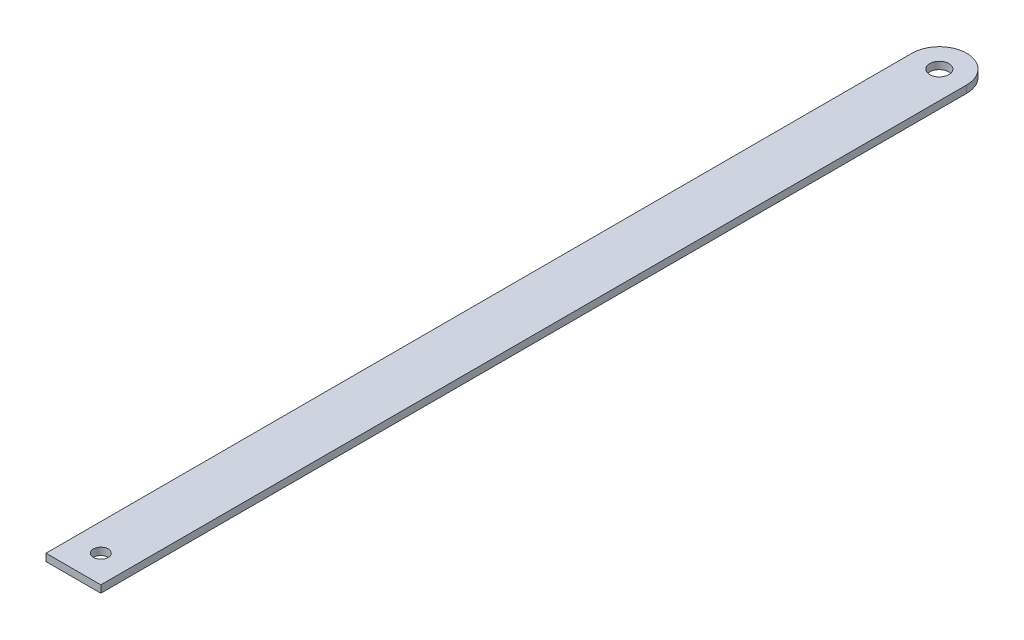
ISO-10303-21;
HEADER;
FILE_DESCRIPTION(('STEP AP214'),'2;1');
FILE_NAME('part.step','',(''),(''),'','','');
FILE_SCHEMA(('AUTOMOTIVE_DESIGN { 1 0 10303 214 1 1 1 1 }'));
ENDSEC;
DATA;
#1=APPLICATION_CONTEXT('core data for automotive mechanical design processes');
#2=APPLICATION_PROTOCOL_DEFINITION('international standard','automotive_design',2000,#1);
#3=PRODUCT_CONTEXT('',#1,'mechanical');
#4=PRODUCT('Part','Part','',(#3));
#5=PRODUCT_RELATED_PRODUCT_CATEGORY('part','',(#4));
#6=PRODUCT_DEFINITION_FORMATION('','',#4);
#7=PRODUCT_DEFINITION_CONTEXT('part definition',#1,'design');
#8=PRODUCT_DEFINITION('design','',#6,#7);
#9=PRODUCT_DEFINITION_SHAPE('','',#8);
#10=(LENGTH_UNIT() NAMED_UNIT(*) SI_UNIT(.MILLI.,.METRE.));
#11=(NAMED_UNIT(*) PLANE_ANGLE_UNIT() SI_UNIT($,.RADIAN.));
#12=(NAMED_UNIT(*) SI_UNIT($,.STERADIAN.) SOLID_ANGLE_UNIT());
#13=UNCERTAINTY_MEASURE_WITH_UNIT(LENGTH_MEASURE(1.E-05),#10,'distance_accuracy_value','');
#14=(GEOMETRIC_REPRESENTATION_CONTEXT(3) GLOBAL_UNCERTAINTY_ASSIGNED_CONTEXT((#13)) GLOBAL_UNIT_ASSIGNED_CONTEXT((#10,
#11,#12)) REPRESENTATION_CONTEXT('',''));
#15=CARTESIAN_POINT('',(0.,0.,0.));
#16=DIRECTION('',(0.,0.,1.));
#17=DIRECTION('',(1.,0.,0.));
#18=AXIS2_PLACEMENT_3D('',#15,#16,#17);
#19=CARTESIAN_POINT('',(1141.63509440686,4.,-1873.52597023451));
#20=DIRECTION('',(0.,1.,0.));
#21=DIRECTION('',(0.,0.,1.));
#22=AXIS2_PLACEMENT_3D('',#19,#20,#21);
#23=PLANE('',#22);
#24=CARTESIAN_POINT('',(1141.63509440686,4.,-1873.52597023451));
#25=DIRECTION('',(0.,1.,0.));
#26=DIRECTION('',(0.,0.,1.));
#27=AXIS2_PLACEMENT_3D('',#24,#25,#26);
#28=CIRCLE('',#27,5.25000000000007);
#29=CARTESIAN_POINT('',(1141.63509440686,4.,-1868.27597023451));
#30=VERTEX_POINT('',#29);
#31=EDGE_CURVE('E99',#30,#30,#28,.T.);
#32=ORIENTED_EDGE('',*,*,#31,.F.);
#33=EDGE_LOOP('',(#32));
#34=FACE_BOUND('',#33,.T.);
#35=CARTESIAN_POINT('',(1141.63509440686,4.,-1873.52597023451));
#36=DIRECTION('',(0.,1.,0.));
#37=DIRECTION('',(0.,0.,1.));
#38=AXIS2_PLACEMENT_3D('',#35,#36,#37);
#39=CIRCLE('',#38,15.);
#40=CARTESIAN_POINT('',(1156.63509440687,4.,-1873.52597023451));
#41=VERTEX_POINT('',#40);
#42=CARTESIAN_POINT('',(1126.63509440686,4.,-1873.5259702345));
#43=VERTEX_POINT('',#42);
#44=EDGE_CURVE('E84',#41,#43,#39,.T.);
#45=ORIENTED_EDGE('',*,*,#44,.T.);
#46=DIRECTION('',(0.,0.,1.));
#47=VECTOR('',#46,1.);
#48=CARTESIAN_POINT('',(1126.63509440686,4.,-1873.5259702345));
#49=LINE('',#48,#47);
#50=CARTESIAN_POINT('',(1126.63509440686,4.,-1399.60846188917));
#51=VERTEX_POINT('',#50);
#52=EDGE_CURVE('E79',#43,#51,#49,.T.);
#53=ORIENTED_EDGE('',*,*,#52,.T.);
#54=DIRECTION('',(1.,0.,0.));
#55=VECTOR('',#54,1.);
#56=CARTESIAN_POINT('',(1126.63509440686,4.,-1399.60846188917));
#57=LINE('',#56,#55);
#58=CARTESIAN_POINT('',(1156.63509440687,4.,-1399.60846188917));
#59=VERTEX_POINT('',#58);
#60=EDGE_CURVE('E82',#51,#59,#57,.T.);
#61=ORIENTED_EDGE('',*,*,#60,.T.);
#62=DIRECTION('',(0.,0.,-1.));
#63=VECTOR('',#62,1.);
#64=CARTESIAN_POINT('',(1156.63509440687,4.,-1873.52597023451));
#65=LINE('',#64,#63);
#66=EDGE_CURVE('E49',#59,#41,#65,.T.);
#67=ORIENTED_EDGE('',*,*,#66,.T.);
#68=EDGE_LOOP('',(#45,#53,#61,#67));
#69=FACE_BOUND('',#68,.T.);
#70=CARTESIAN_POINT('',(1141.63509440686,4.,-1414.60846188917));
#71=DIRECTION('',(0.,1.,0.));
#72=DIRECTION('',(0.,0.,1.));
#73=AXIS2_PLACEMENT_3D('',#70,#71,#72);
#74=CIRCLE('',#73,4.04999999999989);
#75=CARTESIAN_POINT('',(1141.63509440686,4.,-1410.55846188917));
#76=VERTEX_POINT('',#75);
#77=EDGE_CURVE('E114',#76,#76,#74,.T.);
#78=ORIENTED_EDGE('',*,*,#77,.F.);
#79=EDGE_LOOP('',(#78));
#80=FACE_BOUND('',#79,.T.);
#81=ADVANCED_FACE('F32',(#34,#69,#80),#23,.T.);
#82=CARTESIAN_POINT('',(1141.63509440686,0.,-1873.52597023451));
#83=DIRECTION('',(0.,1.,0.));
#84=DIRECTION('',(0.,0.,1.));
#85=AXIS2_PLACEMENT_3D('',#82,#83,#84);
#86=PLANE('',#85);
#87=CARTESIAN_POINT('',(1141.63509440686,0.,-1873.52597023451));
#88=DIRECTION('',(0.,1.,0.));
#89=DIRECTION('',(0.,0.,1.));
#90=AXIS2_PLACEMENT_3D('',#87,#88,#89);
#91=CIRCLE('',#90,5.25000000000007);
#92=CARTESIAN_POINT('',(1141.63509440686,0.,-1868.27597023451));
#93=VERTEX_POINT('',#92);
#94=EDGE_CURVE('E111',#93,#93,#91,.T.);
#95=ORIENTED_EDGE('',*,*,#94,.T.);
#96=EDGE_LOOP('',(#95));
#97=FACE_BOUND('',#96,.T.);
#98=CARTESIAN_POINT('',(1141.63509440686,0.,-1873.52597023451));
#99=DIRECTION('',(0.,1.,0.));
#100=DIRECTION('',(0.,0.,1.));
#101=AXIS2_PLACEMENT_3D('',#98,#99,#100);
#102=CIRCLE('',#101,15.);
#103=CARTESIAN_POINT('',(1156.63509440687,0.,-1873.52597023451));
#104=VERTEX_POINT('',#103);
#105=CARTESIAN_POINT('',(1126.63509440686,0.,-1873.5259702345));
#106=VERTEX_POINT('',#105);
#107=EDGE_CURVE('E96',#104,#106,#102,.T.);
#108=ORIENTED_EDGE('',*,*,#107,.F.);
#109=DIRECTION('',(0.,0.,-1.));
#110=VECTOR('',#109,1.);
#111=CARTESIAN_POINT('',(1156.63509440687,0.,-1873.52597023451));
#112=LINE('',#111,#110);
#113=CARTESIAN_POINT('',(1156.63509440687,0.,-1399.60846188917));
#114=VERTEX_POINT('',#113);
#115=EDGE_CURVE('E72',#114,#104,#112,.T.);
#116=ORIENTED_EDGE('',*,*,#115,.F.);
#117=DIRECTION('',(1.,0.,0.));
#118=VECTOR('',#117,1.);
#119=CARTESIAN_POINT('',(1126.63509440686,0.,-1399.60846188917));
#120=LINE('',#119,#118);
#121=CARTESIAN_POINT('',(1126.63509440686,0.,-1399.60846188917));
#122=VERTEX_POINT('',#121);
#123=EDGE_CURVE('E66',#122,#114,#120,.T.);
#124=ORIENTED_EDGE('',*,*,#123,.F.);
#125=DIRECTION('',(0.,0.,1.));
#126=VECTOR('',#125,1.);
#127=CARTESIAN_POINT('',(1126.63509440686,0.,-1873.5259702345));
#128=LINE('',#127,#126);
#129=EDGE_CURVE('E88',#106,#122,#128,.T.);
#130=ORIENTED_EDGE('',*,*,#129,.F.);
#131=EDGE_LOOP('',(#108,#116,#124,#130));
#132=FACE_BOUND('',#131,.T.);
#133=CARTESIAN_POINT('',(1141.63509440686,0.,-1414.60846188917));
#134=DIRECTION('',(0.,1.,0.));
#135=DIRECTION('',(0.,0.,1.));
#136=AXIS2_PLACEMENT_3D('',#133,#134,#135);
#137=CIRCLE('',#136,4.04999999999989);
#138=CARTESIAN_POINT('',(1141.63509440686,0.,-1410.55846188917));
#139=VERTEX_POINT('',#138);
#140=EDGE_CURVE('E117',#139,#139,#137,.T.);
#141=ORIENTED_EDGE('',*,*,#140,.T.);
#142=EDGE_LOOP('',(#141));
#143=FACE_BOUND('',#142,.T.);
#144=ADVANCED_FACE('F107',(#97,#132,#143),#86,.F.);
#145=CARTESIAN_POINT('',(1141.63509440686,4.,-1873.52597023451));
#146=DIRECTION('',(0.,-1.,0.));
#147=DIRECTION('',(0.,0.,-1.));
#148=AXIS2_PLACEMENT_3D('',#145,#146,#147);
#149=CYLINDRICAL_SURFACE('',#148,15.);
#150=ORIENTED_EDGE('',*,*,#107,.T.);
#151=DIRECTION('',(0.,-1.,0.));
#152=VECTOR('',#151,1.);
#153=CARTESIAN_POINT('',(1126.63509440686,4.,-1873.5259702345));
#154=LINE('',#153,#152);
#155=EDGE_CURVE('E11',#43,#106,#154,.T.);
#156=ORIENTED_EDGE('',*,*,#155,.F.);
#157=ORIENTED_EDGE('',*,*,#44,.F.);
#158=DIRECTION('',(0.,-1.,0.));
#159=VECTOR('',#158,1.);
#160=CARTESIAN_POINT('',(1156.63509440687,4.,-1873.52597023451));
#161=LINE('',#160,#159);
#162=EDGE_CURVE('E92',#41,#104,#161,.T.);
#163=ORIENTED_EDGE('',*,*,#162,.T.);
#164=EDGE_LOOP('',(#150,#156,#157,#163));
#165=FACE_BOUND('',#164,.T.);
#166=ADVANCED_FACE('F34',(#165),#149,.T.);
#167=CARTESIAN_POINT('',(1126.63509440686,4.,-1873.5259702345));
#168=DIRECTION('',(1.,0.,0.));
#169=DIRECTION('',(0.,0.,-1.));
#170=AXIS2_PLACEMENT_3D('',#167,#168,#169);
#171=PLANE('',#170);
#172=ORIENTED_EDGE('',*,*,#129,.T.);
#173=DIRECTION('',(0.,-1.,0.));
#174=VECTOR('',#173,1.);
#175=CARTESIAN_POINT('',(1126.63509440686,4.,-1399.60846188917));
#176=LINE('',#175,#174);
#177=EDGE_CURVE('E41',#51,#122,#176,.T.);
#178=ORIENTED_EDGE('',*,*,#177,.F.);
#179=ORIENTED_EDGE('',*,*,#52,.F.);
#180=ORIENTED_EDGE('',*,*,#155,.T.);
#181=EDGE_LOOP('',(#172,#178,#179,#180));
#182=FACE_BOUND('',#181,.T.);
#183=ADVANCED_FACE('F87',(#182),#171,.F.);
#184=CARTESIAN_POINT('',(1126.63509440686,4.,-1399.60846188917));
#185=DIRECTION('',(0.,0.,-1.));
#186=DIRECTION('',(-1.,0.,0.));
#187=AXIS2_PLACEMENT_3D('',#184,#185,#186);
#188=PLANE('',#187);
#189=ORIENTED_EDGE('',*,*,#123,.T.);
#190=DIRECTION('',(0.,-1.,0.));
#191=VECTOR('',#190,1.);
#192=CARTESIAN_POINT('',(1156.63509440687,4.,-1399.60846188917));
#193=LINE('',#192,#191);
#194=EDGE_CURVE('E89',#59,#114,#193,.T.);
#195=ORIENTED_EDGE('',*,*,#194,.F.);
#196=ORIENTED_EDGE('',*,*,#60,.F.);
#197=ORIENTED_EDGE('',*,*,#177,.T.);
#198=EDGE_LOOP('',(#189,#195,#196,#197));
#199=FACE_BOUND('',#198,.T.);
#200=ADVANCED_FACE('F90',(#199),#188,.F.);
#201=CARTESIAN_POINT('',(1156.63509440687,4.,-1873.52597023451));
#202=DIRECTION('',(-1.,0.,0.));
#203=DIRECTION('',(0.,0.,1.));
#204=AXIS2_PLACEMENT_3D('',#201,#202,#203);
#205=PLANE('',#204);
#206=ORIENTED_EDGE('',*,*,#115,.T.);
#207=ORIENTED_EDGE('',*,*,#162,.F.);
#208=ORIENTED_EDGE('',*,*,#66,.F.);
#209=ORIENTED_EDGE('',*,*,#194,.T.);
#210=EDGE_LOOP('',(#206,#207,#208,#209));
#211=FACE_BOUND('',#210,.T.);
#212=ADVANCED_FACE('F104',(#211),#205,.F.);
#213=CARTESIAN_POINT('',(1141.63509440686,4.,-1873.52597023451));
#214=DIRECTION('',(0.,-1.,0.));
#215=DIRECTION('',(0.,0.,-1.));
#216=AXIS2_PLACEMENT_3D('',#213,#214,#215);
#217=CYLINDRICAL_SURFACE('',#216,5.25000000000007);
#218=ORIENTED_EDGE('',*,*,#31,.T.);
#219=EDGE_LOOP('',(#218));
#220=FACE_BOUND('',#219,.T.);
#221=ORIENTED_EDGE('',*,*,#94,.F.);
#222=EDGE_LOOP('',(#221));
#223=FACE_BOUND('',#222,.T.);
#224=ADVANCED_FACE('F135',(#220,#223),#217,.F.);
#225=CARTESIAN_POINT('',(1141.63509440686,4.,-1414.60846188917));
#226=DIRECTION('',(0.,-1.,0.));
#227=DIRECTION('',(0.,0.,-1.));
#228=AXIS2_PLACEMENT_3D('',#225,#226,#227);
#229=CYLINDRICAL_SURFACE('',#228,4.04999999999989);
#230=ORIENTED_EDGE('',*,*,#77,.T.);
#231=EDGE_LOOP('',(#230));
#232=FACE_BOUND('',#231,.T.);
#233=ORIENTED_EDGE('',*,*,#140,.F.);
#234=EDGE_LOOP('',(#233));
#235=FACE_BOUND('',#234,.T.);
#236=ADVANCED_FACE('F123',(#232,#235),#229,.F.);
#237=CLOSED_SHELL('',(#81,#144,#166,#183,#200,#212,#224,#236));
#238=MANIFOLD_SOLID_BREP('B2',#237);
#239=ADVANCED_BREP_SHAPE_REPRESENTATION('',(#18,#238),#14);
#240=SHAPE_DEFINITION_REPRESENTATION(#9,#239);
ENDSEC;
END-ISO-10303-21;
